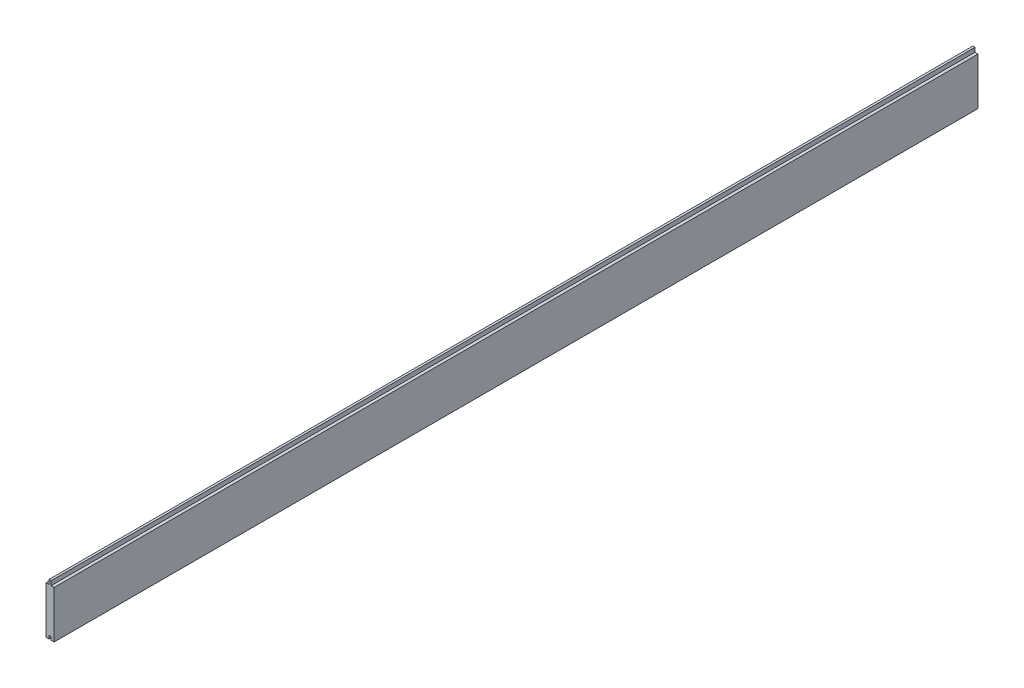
from build123d import *

# Parameters (mm, degrees)
ESQUISSE1_W        = 4
ESQUISSE1_H        = 8
BOSS_EXTRU_1_DEPTH = 1700


with BuildPart() as part:
    # Esquisse1 → Boss.-Extru.1 (new body)
    with BuildSketch(Plane.XY):
        Polygon((-2, 43.5), (-7.5, 43.5), (-7.5, -43.5), (-2, -43.5), (-2, -37.5), (2, -37.5), (2, -43.5), (7.5, -43.5), (7.5, 43.5), (2, 43.5), (2, 35.5), (-2, 35.5), align=None)
        with Locations((0, 47.5)):
            Rectangle(ESQUISSE1_W, ESQUISSE1_H)
        with Locations((0, 39.5)):
            Rectangle(ESQUISSE1_W, ESQUISSE1_H)
    extrude(amount=BOSS_EXTRU_1_DEPTH)


solid = part.part
